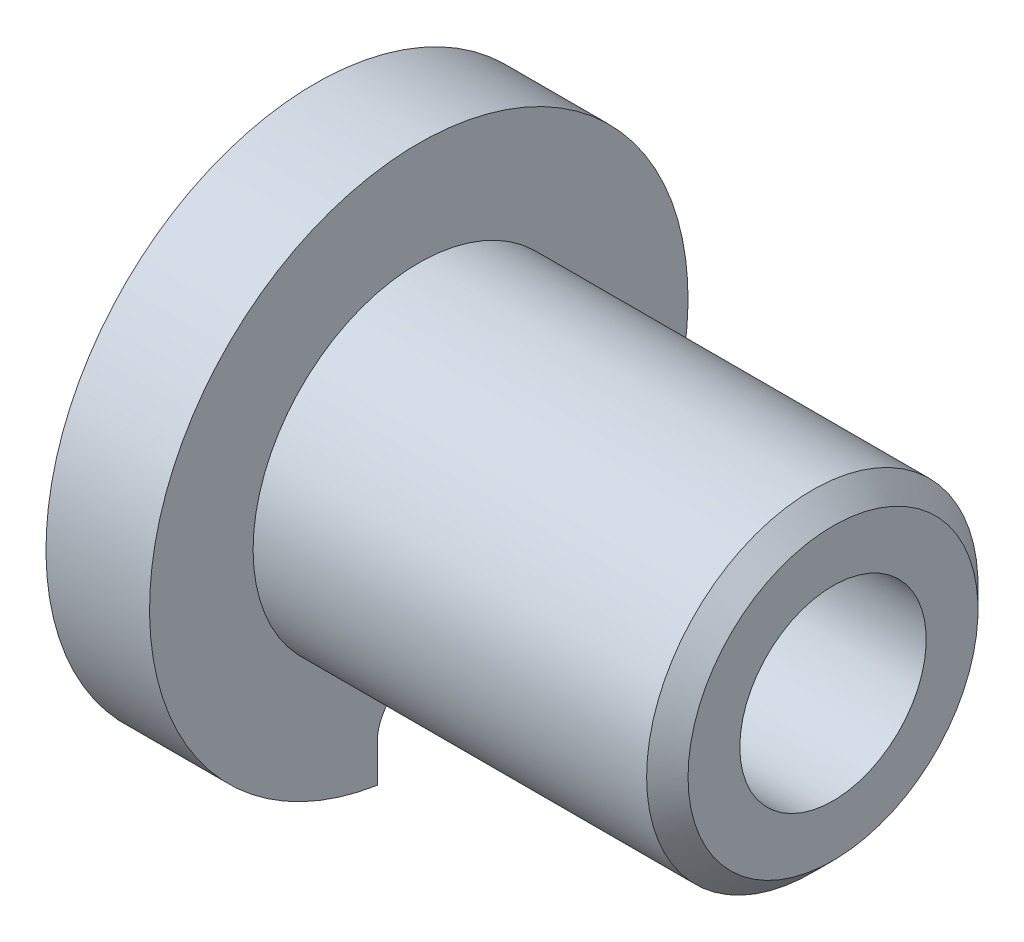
ISO-10303-21;
HEADER;
FILE_DESCRIPTION(('STEP AP214'),'2;1');
FILE_NAME('part.step','',(''),(''),'','','');
FILE_SCHEMA(('AUTOMOTIVE_DESIGN { 1 0 10303 214 1 1 1 1 }'));
ENDSEC;
DATA;
#1=APPLICATION_CONTEXT('core data for automotive mechanical design processes');
#2=APPLICATION_PROTOCOL_DEFINITION('international standard','automotive_design',2000,#1);
#3=PRODUCT_CONTEXT('',#1,'mechanical');
#4=PRODUCT('Part','Part','',(#3));
#5=PRODUCT_RELATED_PRODUCT_CATEGORY('part','',(#4));
#6=PRODUCT_DEFINITION_FORMATION('','',#4);
#7=PRODUCT_DEFINITION_CONTEXT('part definition',#1,'design');
#8=PRODUCT_DEFINITION('design','',#6,#7);
#9=PRODUCT_DEFINITION_SHAPE('','',#8);
#10=(LENGTH_UNIT() NAMED_UNIT(*) SI_UNIT(.MILLI.,.METRE.));
#11=(NAMED_UNIT(*) PLANE_ANGLE_UNIT() SI_UNIT($,.RADIAN.));
#12=(NAMED_UNIT(*) SI_UNIT($,.STERADIAN.) SOLID_ANGLE_UNIT());
#13=UNCERTAINTY_MEASURE_WITH_UNIT(LENGTH_MEASURE(1.E-05),#10,'distance_accuracy_value','');
#14=(GEOMETRIC_REPRESENTATION_CONTEXT(3) GLOBAL_UNCERTAINTY_ASSIGNED_CONTEXT((#13)) GLOBAL_UNIT_ASSIGNED_CONTEXT((#10,
#11,#12)) REPRESENTATION_CONTEXT('',''));
#15=CARTESIAN_POINT('',(0.,0.,0.));
#16=DIRECTION('',(0.,0.,1.));
#17=DIRECTION('',(1.,0.,0.));
#18=AXIS2_PLACEMENT_3D('',#15,#16,#17);
#19=CARTESIAN_POINT('',(0.,13.,0.));
#20=DIRECTION('',(1.,0.,0.));
#21=DIRECTION('',(0.,0.,-1.));
#22=AXIS2_PLACEMENT_3D('',#19,#20,#21);
#23=PLANE('',#22);
#24=CARTESIAN_POINT('',(0.,0.,0.));
#25=DIRECTION('',(-1.,0.,0.));
#26=DIRECTION('',(0.,0.,1.));
#27=AXIS2_PLACEMENT_3D('',#24,#25,#26);
#28=CIRCLE('',#27,4.5);
#29=CARTESIAN_POINT('',(0.,0.,4.5));
#30=VERTEX_POINT('',#29);
#31=EDGE_CURVE('E94',#30,#30,#28,.T.);
#32=ORIENTED_EDGE('',*,*,#31,.F.);
#33=EDGE_LOOP('',(#32));
#34=FACE_BOUND('',#33,.T.);
#35=DIRECTION('',(0.,-1.,0.));
#36=VECTOR('',#35,1.);
#37=CARTESIAN_POINT('',(0.,-11.,2.));
#38=LINE('',#37,#36);
#39=CARTESIAN_POINT('',(0.,-11.,2.));
#40=VERTEX_POINT('',#39);
#41=CARTESIAN_POINT('',(0.,-12.8452325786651,2.));
#42=VERTEX_POINT('',#41);
#43=EDGE_CURVE('E74',#40,#42,#38,.T.);
#44=ORIENTED_EDGE('',*,*,#43,.T.);
#45=CARTESIAN_POINT('',(0.,0.,0.));
#46=DIRECTION('',(-1.,0.,0.));
#47=DIRECTION('',(0.,0.,1.));
#48=AXIS2_PLACEMENT_3D('',#45,#46,#47);
#49=CIRCLE('',#48,13.);
#50=CARTESIAN_POINT('',(0.,-12.8452325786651,-2.));
#51=VERTEX_POINT('',#50);
#52=EDGE_CURVE('E86',#42,#51,#49,.T.);
#53=ORIENTED_EDGE('',*,*,#52,.T.);
#54=DIRECTION('',(0.,-1.,0.));
#55=VECTOR('',#54,1.);
#56=CARTESIAN_POINT('',(0.,-11.,-2.));
#57=LINE('',#56,#55);
#58=CARTESIAN_POINT('',(0.,-11.,-2.));
#59=VERTEX_POINT('',#58);
#60=EDGE_CURVE('E72',#59,#51,#57,.T.);
#61=ORIENTED_EDGE('',*,*,#60,.F.);
#62=CARTESIAN_POINT('',(0.,-11.,0.));
#63=DIRECTION('',(-1.,0.,0.));
#64=DIRECTION('',(0.,0.,1.));
#65=AXIS2_PLACEMENT_3D('',#62,#63,#64);
#66=CIRCLE('',#65,2.);
#67=EDGE_CURVE('E77',#40,#59,#66,.T.);
#68=ORIENTED_EDGE('',*,*,#67,.F.);
#69=EDGE_LOOP('',(#44,#53,#61,#68));
#70=FACE_BOUND('',#69,.T.);
#71=ADVANCED_FACE('F32',(#34,#70),#23,.F.);
#72=CARTESIAN_POINT('',(0.,0.,0.));
#73=DIRECTION('',(-1.,0.,0.));
#74=DIRECTION('',(0.,0.,1.));
#75=AXIS2_PLACEMENT_3D('',#72,#73,#74);
#76=CYLINDRICAL_SURFACE('',#75,13.);
#77=DIRECTION('',(-1.,0.,0.));
#78=VECTOR('',#77,1.);
#79=CARTESIAN_POINT('',(25.,-12.8452325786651,2.));
#80=LINE('',#79,#78);
#81=CARTESIAN_POINT('',(5.,-12.8452325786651,2.));
#82=VERTEX_POINT('',#81);
#83=EDGE_CURVE('E91',#82,#42,#80,.T.);
#84=ORIENTED_EDGE('',*,*,#83,.F.);
#85=CARTESIAN_POINT('',(5.,0.,0.));
#86=DIRECTION('',(-1.,0.,0.));
#87=DIRECTION('',(0.,0.,1.));
#88=AXIS2_PLACEMENT_3D('',#85,#86,#87);
#89=CIRCLE('',#88,13.);
#90=CARTESIAN_POINT('',(5.,-12.8452325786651,-2.));
#91=VERTEX_POINT('',#90);
#92=EDGE_CURVE('E103',#82,#91,#89,.T.);
#93=ORIENTED_EDGE('',*,*,#92,.T.);
#94=DIRECTION('',(-1.,0.,0.));
#95=VECTOR('',#94,1.);
#96=CARTESIAN_POINT('',(25.,-12.8452325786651,-2.));
#97=LINE('',#96,#95);
#98=EDGE_CURVE('E46',#91,#51,#97,.T.);
#99=ORIENTED_EDGE('',*,*,#98,.T.);
#100=ORIENTED_EDGE('',*,*,#52,.F.);
#101=EDGE_LOOP('',(#84,#93,#99,#100));
#102=FACE_BOUND('',#101,.T.);
#103=ADVANCED_FACE('F121',(#102),#76,.T.);
#104=CARTESIAN_POINT('',(5.,8.,0.));
#105=DIRECTION('',(-1.,0.,0.));
#106=DIRECTION('',(0.,0.,1.));
#107=AXIS2_PLACEMENT_3D('',#104,#105,#106);
#108=PLANE('',#107);
#109=CARTESIAN_POINT('',(5.,0.,0.));
#110=DIRECTION('',(-1.,0.,0.));
#111=DIRECTION('',(0.,0.,1.));
#112=AXIS2_PLACEMENT_3D('',#109,#110,#111);
#113=CIRCLE('',#112,8.);
#114=CARTESIAN_POINT('',(5.,0.,8.));
#115=VERTEX_POINT('',#114);
#116=EDGE_CURVE('E100',#115,#115,#113,.T.);
#117=ORIENTED_EDGE('',*,*,#116,.T.);
#118=EDGE_LOOP('',(#117));
#119=FACE_BOUND('',#118,.T.);
#120=DIRECTION('',(0.,-1.,0.));
#121=VECTOR('',#120,1.);
#122=CARTESIAN_POINT('',(5.,8.,2.));
#123=LINE('',#122,#121);
#124=CARTESIAN_POINT('',(5.,-11.,2.));
#125=VERTEX_POINT('',#124);
#126=EDGE_CURVE('E11',#125,#82,#123,.T.);
#127=ORIENTED_EDGE('',*,*,#126,.F.);
#128=CARTESIAN_POINT('',(5.,-11.,0.));
#129=DIRECTION('',(-1.,0.,0.));
#130=DIRECTION('',(0.,0.,1.));
#131=AXIS2_PLACEMENT_3D('',#128,#129,#130);
#132=CIRCLE('',#131,2.);
#133=CARTESIAN_POINT('',(5.,-11.,-2.));
#134=VERTEX_POINT('',#133);
#135=EDGE_CURVE('E39',#125,#134,#132,.T.);
#136=ORIENTED_EDGE('',*,*,#135,.T.);
#137=DIRECTION('',(0.,-1.,0.));
#138=VECTOR('',#137,1.);
#139=CARTESIAN_POINT('',(5.,8.,-2.));
#140=LINE('',#139,#138);
#141=EDGE_CURVE('E73',#134,#91,#140,.T.);
#142=ORIENTED_EDGE('',*,*,#141,.T.);
#143=ORIENTED_EDGE('',*,*,#92,.F.);
#144=EDGE_LOOP('',(#127,#136,#142,#143));
#145=FACE_BOUND('',#144,.T.);
#146=ADVANCED_FACE('F115',(#119,#145),#108,.F.);
#147=CARTESIAN_POINT('',(0.,0.,0.));
#148=DIRECTION('',(-1.,0.,0.));
#149=DIRECTION('',(0.,0.,1.));
#150=AXIS2_PLACEMENT_3D('',#147,#148,#149);
#151=CYLINDRICAL_SURFACE('',#150,8.);
#152=CARTESIAN_POINT('',(24.,0.,0.));
#153=DIRECTION('',(-1.,0.,0.));
#154=DIRECTION('',(0.,0.,1.));
#155=AXIS2_PLACEMENT_3D('',#152,#153,#154);
#156=CIRCLE('',#155,8.);
#157=CARTESIAN_POINT('',(24.,0.,8.));
#158=VERTEX_POINT('',#157);
#159=EDGE_CURVE('E107',#158,#158,#156,.T.);
#160=ORIENTED_EDGE('',*,*,#159,.T.);
#161=EDGE_LOOP('',(#160));
#162=FACE_BOUND('',#161,.T.);
#163=ORIENTED_EDGE('',*,*,#116,.F.);
#164=EDGE_LOOP('',(#163));
#165=FACE_BOUND('',#164,.T.);
#166=ADVANCED_FACE('F127',(#162,#165),#151,.T.);
#167=CARTESIAN_POINT('',(25.,4.5,0.));
#168=DIRECTION('',(-1.,0.,0.));
#169=DIRECTION('',(0.,0.,1.));
#170=AXIS2_PLACEMENT_3D('',#167,#168,#169);
#171=PLANE('',#170);
#172=CARTESIAN_POINT('',(25.,0.,0.));
#173=DIRECTION('',(-1.,0.,0.));
#174=DIRECTION('',(0.,0.,1.));
#175=AXIS2_PLACEMENT_3D('',#172,#173,#174);
#176=CIRCLE('',#175,6.99999999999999);
#177=CARTESIAN_POINT('',(25.,0.,6.99999999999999));
#178=VERTEX_POINT('',#177);
#179=EDGE_CURVE('E110',#178,#178,#176,.F.);
#180=ORIENTED_EDGE('',*,*,#179,.T.);
#181=EDGE_LOOP('',(#180));
#182=FACE_BOUND('',#181,.T.);
#183=CARTESIAN_POINT('',(25.,0.,0.));
#184=DIRECTION('',(-1.,0.,0.));
#185=DIRECTION('',(0.,0.,1.));
#186=AXIS2_PLACEMENT_3D('',#183,#184,#185);
#187=CIRCLE('',#186,4.5);
#188=CARTESIAN_POINT('',(25.,0.,4.5));
#189=VERTEX_POINT('',#188);
#190=EDGE_CURVE('E97',#189,#189,#187,.T.);
#191=ORIENTED_EDGE('',*,*,#190,.T.);
#192=EDGE_LOOP('',(#191));
#193=FACE_BOUND('',#192,.T.);
#194=ADVANCED_FACE('F134',(#182,#193),#171,.F.);
#195=CARTESIAN_POINT('',(0.,0.,0.));
#196=DIRECTION('',(-1.,0.,0.));
#197=DIRECTION('',(0.,0.,1.));
#198=AXIS2_PLACEMENT_3D('',#195,#196,#197);
#199=CYLINDRICAL_SURFACE('',#198,4.5);
#200=ORIENTED_EDGE('',*,*,#190,.F.);
#201=EDGE_LOOP('',(#200));
#202=FACE_BOUND('',#201,.T.);
#203=ORIENTED_EDGE('',*,*,#31,.T.);
#204=EDGE_LOOP('',(#203));
#205=FACE_BOUND('',#204,.T.);
#206=ADVANCED_FACE('F138',(#202,#205),#199,.F.);
#207=CARTESIAN_POINT('',(24.,0.,0.));
#208=DIRECTION('',(-1.,0.,0.));
#209=DIRECTION('',(0.,0.,1.));
#210=AXIS2_PLACEMENT_3D('',#207,#208,#209);
#211=CONICAL_SURFACE('',#210,8.,0.785398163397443);
#212=ORIENTED_EDGE('',*,*,#179,.F.);
#213=EDGE_LOOP('',(#212));
#214=FACE_BOUND('',#213,.T.);
#215=ORIENTED_EDGE('',*,*,#159,.F.);
#216=EDGE_LOOP('',(#215));
#217=FACE_BOUND('',#216,.T.);
#218=ADVANCED_FACE('F142',(#214,#217),#211,.T.);
#219=CARTESIAN_POINT('',(25.,-11.,0.));
#220=DIRECTION('',(-1.,0.,0.));
#221=DIRECTION('',(0.,0.,1.));
#222=AXIS2_PLACEMENT_3D('',#219,#220,#221);
#223=CYLINDRICAL_SURFACE('',#222,2.);
#224=DIRECTION('',(-1.,0.,0.));
#225=VECTOR('',#224,1.);
#226=CARTESIAN_POINT('',(25.,-11.,2.));
#227=LINE('',#226,#225);
#228=EDGE_CURVE('E79',#125,#40,#227,.T.);
#229=ORIENTED_EDGE('',*,*,#228,.T.);
#230=ORIENTED_EDGE('',*,*,#67,.T.);
#231=DIRECTION('',(-1.,0.,0.));
#232=VECTOR('',#231,1.);
#233=CARTESIAN_POINT('',(25.,-11.,-2.));
#234=LINE('',#233,#232);
#235=EDGE_CURVE('E68',#134,#59,#234,.T.);
#236=ORIENTED_EDGE('',*,*,#235,.F.);
#237=ORIENTED_EDGE('',*,*,#135,.F.);
#238=EDGE_LOOP('',(#229,#230,#236,#237));
#239=FACE_BOUND('',#238,.T.);
#240=ADVANCED_FACE('F78',(#239),#223,.F.);
#241=CARTESIAN_POINT('',(25.,-11.,2.));
#242=DIRECTION('',(0.,0.,-1.));
#243=DIRECTION('',(0.,1.,0.));
#244=AXIS2_PLACEMENT_3D('',#241,#242,#243);
#245=PLANE('',#244);
#246=ORIENTED_EDGE('',*,*,#126,.T.);
#247=ORIENTED_EDGE('',*,*,#83,.T.);
#248=ORIENTED_EDGE('',*,*,#43,.F.);
#249=ORIENTED_EDGE('',*,*,#228,.F.);
#250=EDGE_LOOP('',(#246,#247,#248,#249));
#251=FACE_BOUND('',#250,.T.);
#252=ADVANCED_FACE('F119',(#251),#245,.T.);
#253=CARTESIAN_POINT('',(25.,-11.,-2.));
#254=DIRECTION('',(0.,0.,-1.));
#255=DIRECTION('',(-1.,0.,0.));
#256=AXIS2_PLACEMENT_3D('',#253,#254,#255);
#257=PLANE('',#256);
#258=ORIENTED_EDGE('',*,*,#235,.T.);
#259=ORIENTED_EDGE('',*,*,#60,.T.);
#260=ORIENTED_EDGE('',*,*,#98,.F.);
#261=ORIENTED_EDGE('',*,*,#141,.F.);
#262=EDGE_LOOP('',(#258,#259,#260,#261));
#263=FACE_BOUND('',#262,.T.);
#264=ADVANCED_FACE('F70',(#263),#257,.F.);
#265=CLOSED_SHELL('',(#71,#103,#146,#166,#194,#206,#218,#240,#252,#264));
#266=MANIFOLD_SOLID_BREP('B2',#265);
#267=ADVANCED_BREP_SHAPE_REPRESENTATION('',(#18,#266),#14);
#268=SHAPE_DEFINITION_REPRESENTATION(#9,#267);
ENDSEC;
END-ISO-10303-21;
